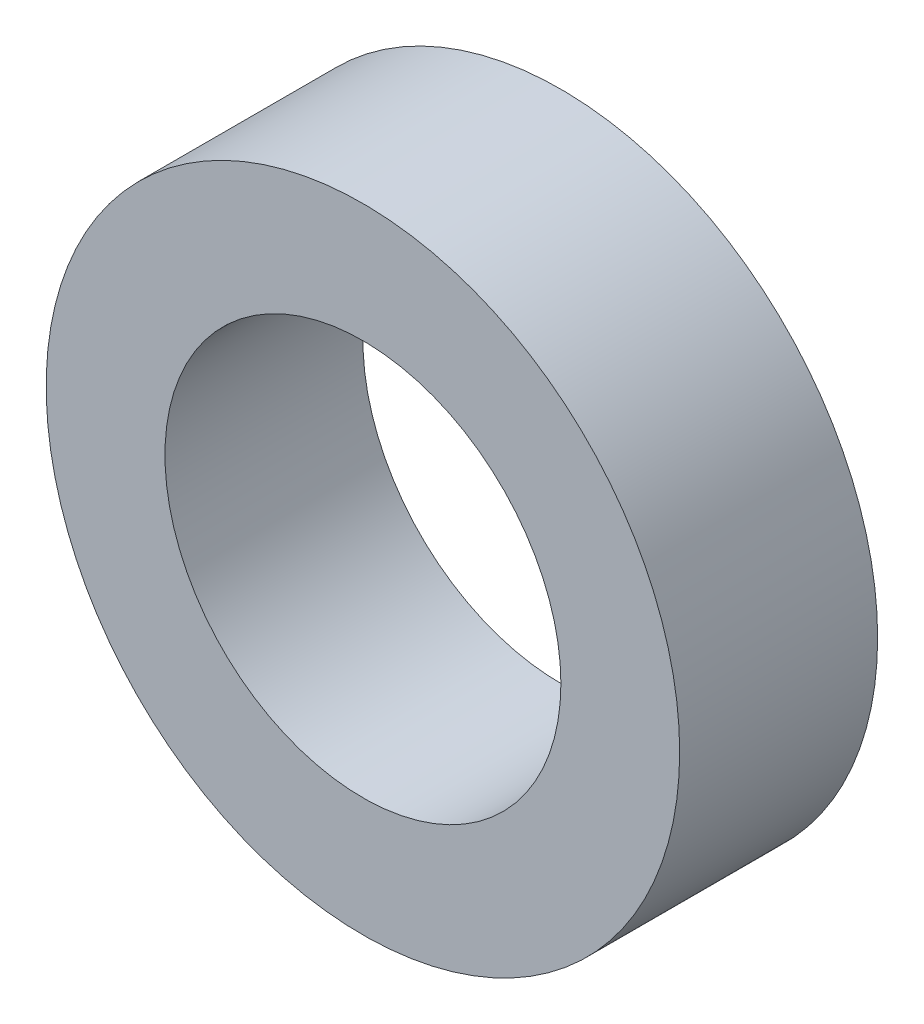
from build123d import *

# Parameters (mm, degrees)
ESQUISSE1_R      = 8
ESQUISSE1_R_2    = 5
EXTRUSION1_DEPTH = 5


with BuildPart() as part:
    # Esquisse1 → Extrusion1 (new body)
    with BuildSketch(Plane.XY):
        Circle(ESQUISSE1_R)
        Circle(ESQUISSE1_R_2, mode=Mode.SUBTRACT)
    extrude(amount=EXTRUSION1_DEPTH)


solid = part.part
